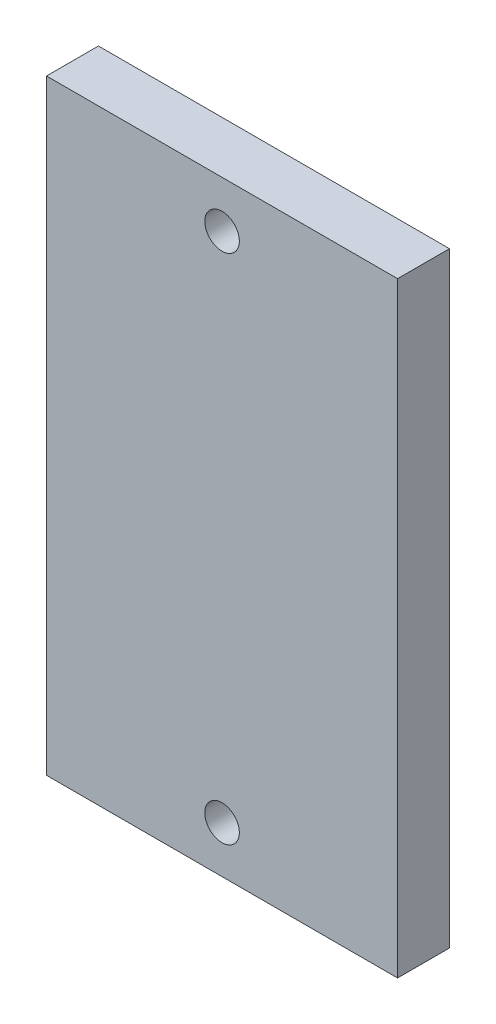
ISO-10303-21;
HEADER;
FILE_DESCRIPTION(('STEP AP214'),'2;1');
FILE_NAME('part.step','',(''),(''),'','','');
FILE_SCHEMA(('AUTOMOTIVE_DESIGN { 1 0 10303 214 1 1 1 1 }'));
ENDSEC;
DATA;
#1=APPLICATION_CONTEXT('core data for automotive mechanical design processes');
#2=APPLICATION_PROTOCOL_DEFINITION('international standard','automotive_design',2000,#1);
#3=PRODUCT_CONTEXT('',#1,'mechanical');
#4=PRODUCT('Part','Part','',(#3));
#5=PRODUCT_RELATED_PRODUCT_CATEGORY('part','',(#4));
#6=PRODUCT_DEFINITION_FORMATION('','',#4);
#7=PRODUCT_DEFINITION_CONTEXT('part definition',#1,'design');
#8=PRODUCT_DEFINITION('design','',#6,#7);
#9=PRODUCT_DEFINITION_SHAPE('','',#8);
#10=(LENGTH_UNIT() NAMED_UNIT(*) SI_UNIT(.MILLI.,.METRE.));
#11=(NAMED_UNIT(*) PLANE_ANGLE_UNIT() SI_UNIT($,.RADIAN.));
#12=(NAMED_UNIT(*) SI_UNIT($,.STERADIAN.) SOLID_ANGLE_UNIT());
#13=UNCERTAINTY_MEASURE_WITH_UNIT(LENGTH_MEASURE(1.E-05),#10,'distance_accuracy_value','');
#14=(GEOMETRIC_REPRESENTATION_CONTEXT(3) GLOBAL_UNCERTAINTY_ASSIGNED_CONTEXT((#13)) GLOBAL_UNIT_ASSIGNED_CONTEXT((#10,
#11,#12)) REPRESENTATION_CONTEXT('',''));
#15=CARTESIAN_POINT('',(0.,0.,0.));
#16=DIRECTION('',(0.,0.,1.));
#17=DIRECTION('',(1.,0.,0.));
#18=AXIS2_PLACEMENT_3D('',#15,#16,#17);
#19=CARTESIAN_POINT('',(219.192365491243,259.951467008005,3.));
#20=DIRECTION('',(0.,0.,1.));
#21=DIRECTION('',(1.,0.,0.));
#22=AXIS2_PLACEMENT_3D('',#19,#20,#21);
#23=PLANE('',#22);
#24=CARTESIAN_POINT('',(209.048939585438,227.651467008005,3.));
#25=DIRECTION('',(0.,0.,1.));
#26=DIRECTION('',(1.,0.,0.));
#27=AXIS2_PLACEMENT_3D('',#24,#25,#26);
#28=CIRCLE('',#27,0.999999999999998);
#29=CARTESIAN_POINT('',(210.048939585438,227.651467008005,3.));
#30=VERTEX_POINT('',#29);
#31=EDGE_CURVE('E99',#30,#30,#28,.T.);
#32=ORIENTED_EDGE('',*,*,#31,.F.);
#33=EDGE_LOOP('',(#32));
#34=FACE_BOUND('',#33,.T.);
#35=DIRECTION('',(0.,1.,0.));
#36=VECTOR('',#35,1.);
#37=CARTESIAN_POINT('',(219.192365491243,224.951467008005,3.));
#38=LINE('',#37,#36);
#39=CARTESIAN_POINT('',(219.192365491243,224.951467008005,3.));
#40=VERTEX_POINT('',#39);
#41=CARTESIAN_POINT('',(219.192365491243,259.951467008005,3.));
#42=VERTEX_POINT('',#41);
#43=EDGE_CURVE('E84',#40,#42,#38,.T.);
#44=ORIENTED_EDGE('',*,*,#43,.T.);
#45=DIRECTION('',(-1.,0.,0.));
#46=VECTOR('',#45,1.);
#47=CARTESIAN_POINT('',(219.192365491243,259.951467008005,3.));
#48=LINE('',#47,#46);
#49=CARTESIAN_POINT('',(198.905513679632,259.951467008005,3.));
#50=VERTEX_POINT('',#49);
#51=EDGE_CURVE('E79',#42,#50,#48,.T.);
#52=ORIENTED_EDGE('',*,*,#51,.T.);
#53=DIRECTION('',(0.,-1.,0.));
#54=VECTOR('',#53,1.);
#55=CARTESIAN_POINT('',(198.905513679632,259.951467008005,3.));
#56=LINE('',#55,#54);
#57=CARTESIAN_POINT('',(198.905513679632,224.951467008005,3.));
#58=VERTEX_POINT('',#57);
#59=EDGE_CURVE('E82',#50,#58,#56,.T.);
#60=ORIENTED_EDGE('',*,*,#59,.T.);
#61=DIRECTION('',(1.,0.,0.));
#62=VECTOR('',#61,1.);
#63=CARTESIAN_POINT('',(198.905513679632,224.951467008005,3.));
#64=LINE('',#63,#62);
#65=EDGE_CURVE('E49',#58,#40,#64,.T.);
#66=ORIENTED_EDGE('',*,*,#65,.T.);
#67=EDGE_LOOP('',(#44,#52,#60,#66));
#68=FACE_BOUND('',#67,.T.);
#69=CARTESIAN_POINT('',(209.048939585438,257.251467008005,3.));
#70=DIRECTION('',(0.,0.,1.));
#71=DIRECTION('',(1.,0.,0.));
#72=AXIS2_PLACEMENT_3D('',#69,#70,#71);
#73=CIRCLE('',#72,0.999999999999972);
#74=CARTESIAN_POINT('',(210.048939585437,257.251467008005,3.));
#75=VERTEX_POINT('',#74);
#76=EDGE_CURVE('E114',#75,#75,#73,.T.);
#77=ORIENTED_EDGE('',*,*,#76,.F.);
#78=EDGE_LOOP('',(#77));
#79=FACE_BOUND('',#78,.T.);
#80=ADVANCED_FACE('F32',(#34,#68,#79),#23,.T.);
#81=CARTESIAN_POINT('',(219.192365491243,259.951467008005,0.));
#82=DIRECTION('',(0.,0.,1.));
#83=DIRECTION('',(1.,0.,0.));
#84=AXIS2_PLACEMENT_3D('',#81,#82,#83);
#85=PLANE('',#84);
#86=CARTESIAN_POINT('',(209.048939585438,227.651467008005,0.));
#87=DIRECTION('',(0.,0.,1.));
#88=DIRECTION('',(1.,0.,0.));
#89=AXIS2_PLACEMENT_3D('',#86,#87,#88);
#90=CIRCLE('',#89,0.999999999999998);
#91=CARTESIAN_POINT('',(210.048939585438,227.651467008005,0.));
#92=VERTEX_POINT('',#91);
#93=EDGE_CURVE('E111',#92,#92,#90,.T.);
#94=ORIENTED_EDGE('',*,*,#93,.T.);
#95=EDGE_LOOP('',(#94));
#96=FACE_BOUND('',#95,.T.);
#97=DIRECTION('',(0.,1.,0.));
#98=VECTOR('',#97,1.);
#99=CARTESIAN_POINT('',(219.192365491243,224.951467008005,0.));
#100=LINE('',#99,#98);
#101=CARTESIAN_POINT('',(219.192365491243,224.951467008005,0.));
#102=VERTEX_POINT('',#101);
#103=CARTESIAN_POINT('',(219.192365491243,259.951467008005,0.));
#104=VERTEX_POINT('',#103);
#105=EDGE_CURVE('E96',#102,#104,#100,.T.);
#106=ORIENTED_EDGE('',*,*,#105,.F.);
#107=DIRECTION('',(1.,0.,0.));
#108=VECTOR('',#107,1.);
#109=CARTESIAN_POINT('',(198.905513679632,224.951467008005,0.));
#110=LINE('',#109,#108);
#111=CARTESIAN_POINT('',(198.905513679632,224.951467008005,0.));
#112=VERTEX_POINT('',#111);
#113=EDGE_CURVE('E72',#112,#102,#110,.T.);
#114=ORIENTED_EDGE('',*,*,#113,.F.);
#115=DIRECTION('',(0.,-1.,0.));
#116=VECTOR('',#115,1.);
#117=CARTESIAN_POINT('',(198.905513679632,259.951467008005,0.));
#118=LINE('',#117,#116);
#119=CARTESIAN_POINT('',(198.905513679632,259.951467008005,0.));
#120=VERTEX_POINT('',#119);
#121=EDGE_CURVE('E66',#120,#112,#118,.T.);
#122=ORIENTED_EDGE('',*,*,#121,.F.);
#123=DIRECTION('',(-1.,0.,0.));
#124=VECTOR('',#123,1.);
#125=CARTESIAN_POINT('',(219.192365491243,259.951467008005,0.));
#126=LINE('',#125,#124);
#127=EDGE_CURVE('E88',#104,#120,#126,.T.);
#128=ORIENTED_EDGE('',*,*,#127,.F.);
#129=EDGE_LOOP('',(#106,#114,#122,#128));
#130=FACE_BOUND('',#129,.T.);
#131=CARTESIAN_POINT('',(209.048939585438,257.251467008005,0.));
#132=DIRECTION('',(0.,0.,1.));
#133=DIRECTION('',(1.,0.,0.));
#134=AXIS2_PLACEMENT_3D('',#131,#132,#133);
#135=CIRCLE('',#134,0.999999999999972);
#136=CARTESIAN_POINT('',(210.048939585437,257.251467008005,0.));
#137=VERTEX_POINT('',#136);
#138=EDGE_CURVE('E117',#137,#137,#135,.T.);
#139=ORIENTED_EDGE('',*,*,#138,.T.);
#140=EDGE_LOOP('',(#139));
#141=FACE_BOUND('',#140,.T.);
#142=ADVANCED_FACE('F107',(#96,#130,#141),#85,.F.);
#143=CARTESIAN_POINT('',(219.192365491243,224.951467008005,3.));
#144=DIRECTION('',(-1.,0.,0.));
#145=DIRECTION('',(0.,0.,1.));
#146=AXIS2_PLACEMENT_3D('',#143,#144,#145);
#147=PLANE('',#146);
#148=ORIENTED_EDGE('',*,*,#105,.T.);
#149=DIRECTION('',(0.,0.,-1.));
#150=VECTOR('',#149,1.);
#151=CARTESIAN_POINT('',(219.192365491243,259.951467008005,3.));
#152=LINE('',#151,#150);
#153=EDGE_CURVE('E11',#42,#104,#152,.T.);
#154=ORIENTED_EDGE('',*,*,#153,.F.);
#155=ORIENTED_EDGE('',*,*,#43,.F.);
#156=DIRECTION('',(0.,0.,-1.));
#157=VECTOR('',#156,1.);
#158=CARTESIAN_POINT('',(219.192365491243,224.951467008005,3.));
#159=LINE('',#158,#157);
#160=EDGE_CURVE('E92',#40,#102,#159,.T.);
#161=ORIENTED_EDGE('',*,*,#160,.T.);
#162=EDGE_LOOP('',(#148,#154,#155,#161));
#163=FACE_BOUND('',#162,.T.);
#164=ADVANCED_FACE('F34',(#163),#147,.F.);
#165=CARTESIAN_POINT('',(219.192365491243,259.951467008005,3.));
#166=DIRECTION('',(0.,-1.,0.));
#167=DIRECTION('',(0.,0.,-1.));
#168=AXIS2_PLACEMENT_3D('',#165,#166,#167);
#169=PLANE('',#168);
#170=ORIENTED_EDGE('',*,*,#127,.T.);
#171=DIRECTION('',(0.,0.,-1.));
#172=VECTOR('',#171,1.);
#173=CARTESIAN_POINT('',(198.905513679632,259.951467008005,3.));
#174=LINE('',#173,#172);
#175=EDGE_CURVE('E41',#50,#120,#174,.T.);
#176=ORIENTED_EDGE('',*,*,#175,.F.);
#177=ORIENTED_EDGE('',*,*,#51,.F.);
#178=ORIENTED_EDGE('',*,*,#153,.T.);
#179=EDGE_LOOP('',(#170,#176,#177,#178));
#180=FACE_BOUND('',#179,.T.);
#181=ADVANCED_FACE('F87',(#180),#169,.F.);
#182=CARTESIAN_POINT('',(198.905513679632,259.951467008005,3.));
#183=DIRECTION('',(1.,0.,0.));
#184=DIRECTION('',(0.,0.,-1.));
#185=AXIS2_PLACEMENT_3D('',#182,#183,#184);
#186=PLANE('',#185);
#187=ORIENTED_EDGE('',*,*,#121,.T.);
#188=DIRECTION('',(0.,0.,-1.));
#189=VECTOR('',#188,1.);
#190=CARTESIAN_POINT('',(198.905513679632,224.951467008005,3.));
#191=LINE('',#190,#189);
#192=EDGE_CURVE('E89',#58,#112,#191,.T.);
#193=ORIENTED_EDGE('',*,*,#192,.F.);
#194=ORIENTED_EDGE('',*,*,#59,.F.);
#195=ORIENTED_EDGE('',*,*,#175,.T.);
#196=EDGE_LOOP('',(#187,#193,#194,#195));
#197=FACE_BOUND('',#196,.T.);
#198=ADVANCED_FACE('F90',(#197),#186,.F.);
#199=CARTESIAN_POINT('',(198.905513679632,224.951467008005,3.));
#200=DIRECTION('',(0.,1.,0.));
#201=DIRECTION('',(0.,0.,1.));
#202=AXIS2_PLACEMENT_3D('',#199,#200,#201);
#203=PLANE('',#202);
#204=ORIENTED_EDGE('',*,*,#113,.T.);
#205=ORIENTED_EDGE('',*,*,#160,.F.);
#206=ORIENTED_EDGE('',*,*,#65,.F.);
#207=ORIENTED_EDGE('',*,*,#192,.T.);
#208=EDGE_LOOP('',(#204,#205,#206,#207));
#209=FACE_BOUND('',#208,.T.);
#210=ADVANCED_FACE('F104',(#209),#203,.F.);
#211=CARTESIAN_POINT('',(209.048939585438,227.651467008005,3.));
#212=DIRECTION('',(0.,0.,-1.));
#213=DIRECTION('',(-1.,0.,0.));
#214=AXIS2_PLACEMENT_3D('',#211,#212,#213);
#215=CYLINDRICAL_SURFACE('',#214,0.999999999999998);
#216=ORIENTED_EDGE('',*,*,#31,.T.);
#217=EDGE_LOOP('',(#216));
#218=FACE_BOUND('',#217,.T.);
#219=ORIENTED_EDGE('',*,*,#93,.F.);
#220=EDGE_LOOP('',(#219));
#221=FACE_BOUND('',#220,.T.);
#222=ADVANCED_FACE('F135',(#218,#221),#215,.F.);
#223=CARTESIAN_POINT('',(209.048939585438,257.251467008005,3.));
#224=DIRECTION('',(0.,0.,-1.));
#225=DIRECTION('',(-1.,0.,0.));
#226=AXIS2_PLACEMENT_3D('',#223,#224,#225);
#227=CYLINDRICAL_SURFACE('',#226,0.999999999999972);
#228=ORIENTED_EDGE('',*,*,#76,.T.);
#229=EDGE_LOOP('',(#228));
#230=FACE_BOUND('',#229,.T.);
#231=ORIENTED_EDGE('',*,*,#138,.F.);
#232=EDGE_LOOP('',(#231));
#233=FACE_BOUND('',#232,.T.);
#234=ADVANCED_FACE('F123',(#230,#233),#227,.F.);
#235=CLOSED_SHELL('',(#80,#142,#164,#181,#198,#210,#222,#234));
#236=MANIFOLD_SOLID_BREP('B2',#235);
#237=ADVANCED_BREP_SHAPE_REPRESENTATION('',(#18,#236),#14);
#238=SHAPE_DEFINITION_REPRESENTATION(#9,#237);
ENDSEC;
END-ISO-10303-21;
